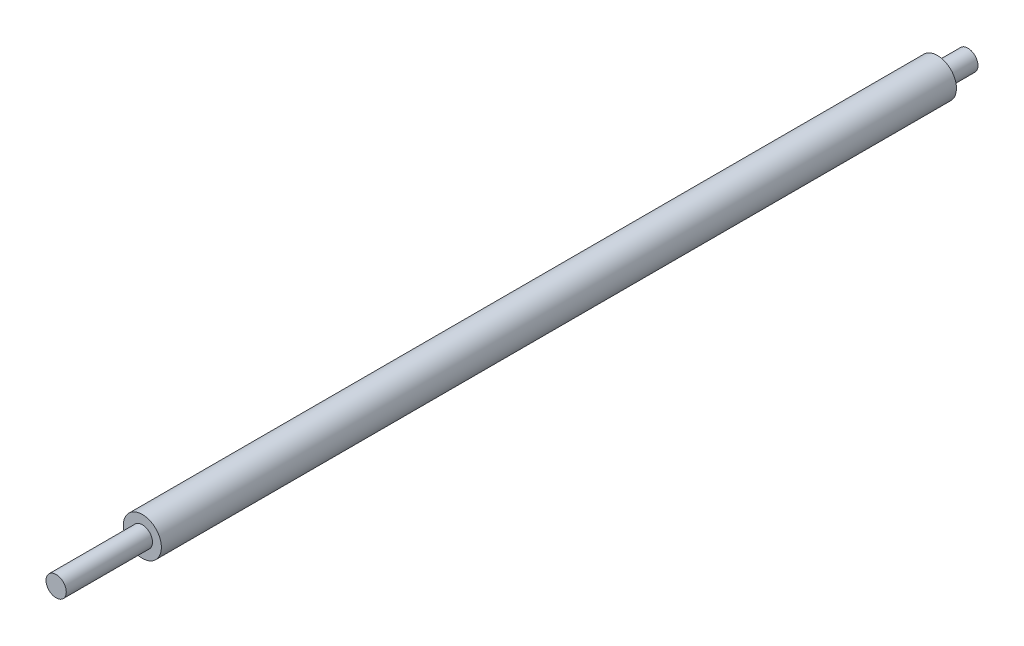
from build123d import *

# Parameters (mm, degrees)
CROQUIS1_R     = 7.5
EXTRUIR2_DEPTH = 313.5
CROQUIS3_R     = 4
EXTRUIR3_DEPTH = 34
EXTRUIR4_START = 12
CROQUIS4_R     = 4
EXTRUIR4_DEPTH = 12


with BuildPart() as part:
    # Croquis1 → Extruir2 (new body)
    with BuildSketch(Plane.XY):
        Circle(CROQUIS1_R)
    extrude(amount=EXTRUIR2_DEPTH)

    # Croquis3 → Extruir3 (add)
    with BuildSketch(Plane.XY.offset(313.5)):
        Circle(CROQUIS3_R)
    extrude(amount=EXTRUIR3_DEPTH)

    # Croquis4 → Extruir4 (add)
    with BuildSketch(Plane(origin=(0, 0, 0), x_dir=(-1, 0, 0), z_dir=(0, 0, -1)).offset(EXTRUIR4_START)):
        with Locations(Location((0, 0, 0), (0, 0, 180))):
            Circle(CROQUIS4_R)
    extrude(amount=-EXTRUIR4_DEPTH)


solid = part.part
